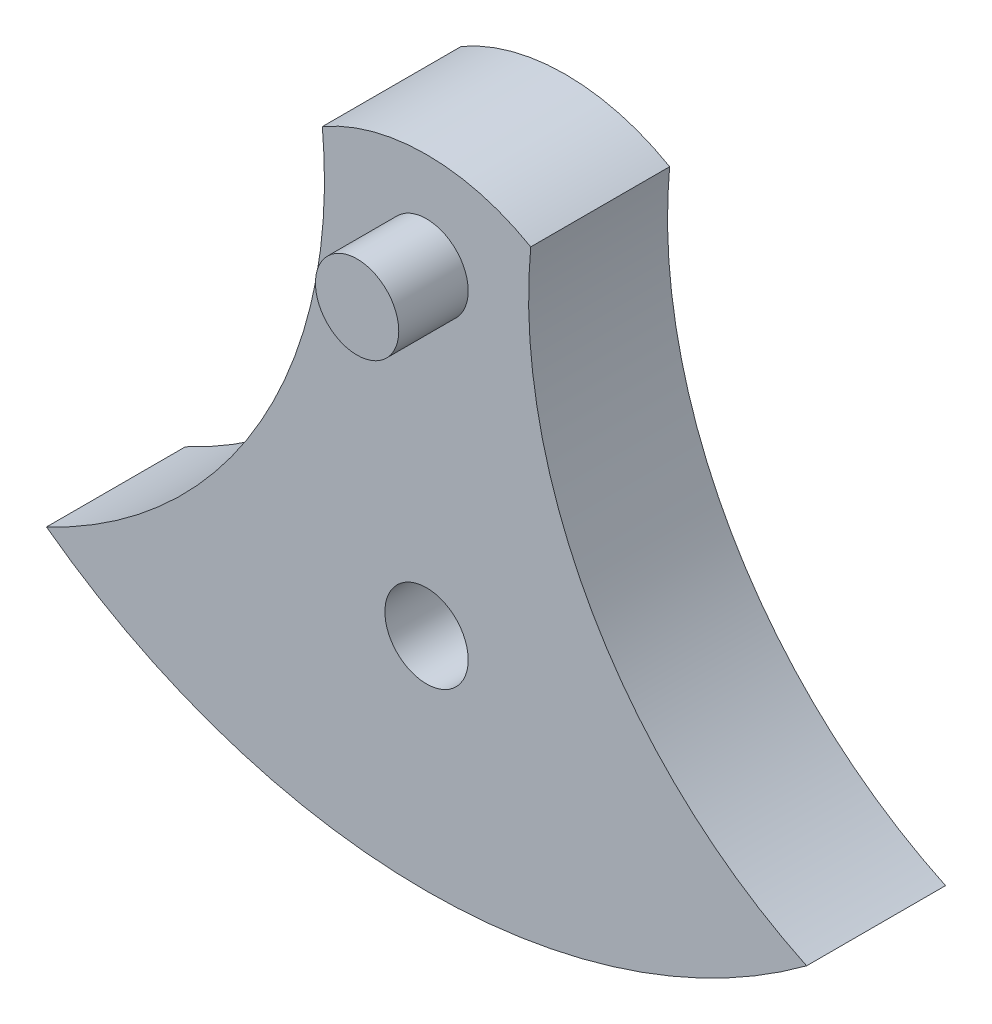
ISO-10303-21;
HEADER;
FILE_DESCRIPTION(('STEP AP214'),'2;1');
FILE_NAME('part.step','',(''),(''),'','','');
FILE_SCHEMA(('AUTOMOTIVE_DESIGN { 1 0 10303 214 1 1 1 1 }'));
ENDSEC;
DATA;
#1=APPLICATION_CONTEXT('core data for automotive mechanical design processes');
#2=APPLICATION_PROTOCOL_DEFINITION('international standard','automotive_design',2000,#1);
#3=PRODUCT_CONTEXT('',#1,'mechanical');
#4=PRODUCT('Part','Part','',(#3));
#5=PRODUCT_RELATED_PRODUCT_CATEGORY('part','',(#4));
#6=PRODUCT_DEFINITION_FORMATION('','',#4);
#7=PRODUCT_DEFINITION_CONTEXT('part definition',#1,'design');
#8=PRODUCT_DEFINITION('design','',#6,#7);
#9=PRODUCT_DEFINITION_SHAPE('','',#8);
#10=(LENGTH_UNIT() NAMED_UNIT(*) SI_UNIT(.MILLI.,.METRE.));
#11=(NAMED_UNIT(*) PLANE_ANGLE_UNIT() SI_UNIT($,.RADIAN.));
#12=(NAMED_UNIT(*) SI_UNIT($,.STERADIAN.) SOLID_ANGLE_UNIT());
#13=UNCERTAINTY_MEASURE_WITH_UNIT(LENGTH_MEASURE(1.E-05),#10,'distance_accuracy_value','');
#14=(GEOMETRIC_REPRESENTATION_CONTEXT(3) GLOBAL_UNCERTAINTY_ASSIGNED_CONTEXT((#13)) GLOBAL_UNIT_ASSIGNED_CONTEXT((#10,
#11,#12)) REPRESENTATION_CONTEXT('',''));
#15=CARTESIAN_POINT('',(0.,0.,0.));
#16=DIRECTION('',(0.,0.,1.));
#17=DIRECTION('',(1.,0.,0.));
#18=AXIS2_PLACEMENT_3D('',#15,#16,#17);
#19=CARTESIAN_POINT('',(0.,0.,5.));
#20=DIRECTION('',(0.,0.,-1.));
#21=DIRECTION('',(-1.,0.,0.));
#22=AXIS2_PLACEMENT_3D('',#19,#20,#21);
#23=CYLINDRICAL_SURFACE('',#22,3.);
#24=CARTESIAN_POINT('',(0.,0.,5.));
#25=DIRECTION('',(0.,0.,1.));
#26=DIRECTION('',(1.,0.,0.));
#27=AXIS2_PLACEMENT_3D('',#24,#25,#26);
#28=CIRCLE('',#27,3.);
#29=CARTESIAN_POINT('',(3.,0.,5.));
#30=VERTEX_POINT('',#29);
#31=EDGE_CURVE('E11',#30,#30,#28,.T.);
#32=ORIENTED_EDGE('',*,*,#31,.F.);
#33=EDGE_LOOP('',(#32));
#34=FACE_BOUND('',#33,.T.);
#35=CARTESIAN_POINT('',(0.,0.,0.));
#36=DIRECTION('',(0.,0.,1.));
#37=DIRECTION('',(1.,0.,0.));
#38=AXIS2_PLACEMENT_3D('',#35,#36,#37);
#39=CIRCLE('',#38,3.);
#40=CARTESIAN_POINT('',(3.,0.,0.));
#41=VERTEX_POINT('',#40);
#42=EDGE_CURVE('E43',#41,#41,#39,.T.);
#43=ORIENTED_EDGE('',*,*,#42,.T.);
#44=EDGE_LOOP('',(#43));
#45=FACE_BOUND('',#44,.T.);
#46=ADVANCED_FACE('F40',(#34,#45),#23,.T.);
#47=CARTESIAN_POINT('',(0.,-71.6629294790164,5.));
#48=DIRECTION('',(0.,0.,1.));
#49=DIRECTION('',(1.,0.,0.));
#50=AXIS2_PLACEMENT_3D('',#47,#48,#49);
#51=PLANE('',#50);
#52=ORIENTED_EDGE('',*,*,#31,.T.);
#53=EDGE_LOOP('',(#52));
#54=FACE_BOUND('',#53,.T.);
#55=ADVANCED_FACE('F55',(#54),#51,.T.);
#56=CARTESIAN_POINT('',(0.,-71.6629294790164,0.));
#57=DIRECTION('',(0.,0.,1.));
#58=DIRECTION('',(1.,0.,0.));
#59=AXIS2_PLACEMENT_3D('',#56,#57,#58);
#60=PLANE('',#59);
#61=ORIENTED_EDGE('',*,*,#42,.F.);
#62=EDGE_LOOP('',(#61));
#63=FACE_BOUND('',#62,.T.);
#64=ADVANCED_FACE('F53',(#63),#60,.F.);
#65=CLOSED_SHELL('',(#46,#55,#64));
#66=MANIFOLD_SOLID_BREP('B2',#65);
#67=CARTESIAN_POINT('',(-42.3474785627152,1.73607018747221,-10.));
#68=DIRECTION('',(0.,0.,1.));
#69=DIRECTION('',(1.,0.,0.));
#70=AXIS2_PLACEMENT_3D('',#67,#68,#69);
#71=CYLINDRICAL_SURFACE('',#70,35.);
#72=CARTESIAN_POINT('',(-42.3474785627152,1.73607018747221,0.));
#73=DIRECTION('',(0.,0.,1.));
#74=DIRECTION('',(1.,0.,0.));
#75=AXIS2_PLACEMENT_3D('',#72,#73,#74);
#76=CIRCLE('',#75,35.);
#77=CARTESIAN_POINT('',(-7.50000000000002,5.,0.));
#78=VERTEX_POINT('',#77);
#79=CARTESIAN_POINT('',(-27.3618481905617,-29.8935185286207,0.));
#80=VERTEX_POINT('',#79);
#81=EDGE_CURVE('E154',#78,#80,#76,.F.);
#82=ORIENTED_EDGE('',*,*,#81,.F.);
#83=DIRECTION('',(0.,0.,1.));
#84=VECTOR('',#83,1.);
#85=CARTESIAN_POINT('',(-7.50000000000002,5.,-10.));
#86=LINE('',#85,#84);
#87=CARTESIAN_POINT('',(-7.50000000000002,5.,-10.));
#88=VERTEX_POINT('',#87);
#89=EDGE_CURVE('E38',#88,#78,#86,.T.);
#90=ORIENTED_EDGE('',*,*,#89,.F.);
#91=CARTESIAN_POINT('',(-42.3474785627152,1.73607018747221,-10.));
#92=DIRECTION('',(0.,0.,1.));
#93=DIRECTION('',(1.,0.,0.));
#94=AXIS2_PLACEMENT_3D('',#91,#92,#93);
#95=CIRCLE('',#94,35.);
#96=CARTESIAN_POINT('',(-27.3618481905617,-29.8935185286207,-10.));
#97=VERTEX_POINT('',#96);
#98=EDGE_CURVE('E141',#88,#97,#95,.F.);
#99=ORIENTED_EDGE('',*,*,#98,.T.);
#100=DIRECTION('',(0.,0.,1.));
#101=VECTOR('',#100,1.);
#102=CARTESIAN_POINT('',(-27.3618481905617,-29.8935185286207,-10.));
#103=LINE('',#102,#101);
#104=EDGE_CURVE('E84',#97,#80,#103,.T.);
#105=ORIENTED_EDGE('',*,*,#104,.T.);
#106=EDGE_LOOP('',(#82,#90,#99,#105));
#107=FACE_BOUND('',#106,.T.);
#108=ADVANCED_FACE('F80',(#107),#71,.F.);
#109=CARTESIAN_POINT('',(0.,-7.99038105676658,-10.));
#110=DIRECTION('',(0.,0.,1.));
#111=DIRECTION('',(1.,0.,0.));
#112=AXIS2_PLACEMENT_3D('',#109,#110,#111);
#113=CYLINDRICAL_SURFACE('',#112,15.);
#114=CARTESIAN_POINT('',(0.,-7.99038105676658,0.));
#115=DIRECTION('',(0.,0.,1.));
#116=DIRECTION('',(1.,0.,0.));
#117=AXIS2_PLACEMENT_3D('',#114,#115,#116);
#118=CIRCLE('',#117,15.);
#119=CARTESIAN_POINT('',(7.50000000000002,5.,0.));
#120=VERTEX_POINT('',#119);
#121=EDGE_CURVE('E160',#78,#120,#118,.F.);
#122=ORIENTED_EDGE('',*,*,#121,.T.);
#123=DIRECTION('',(0.,0.,1.));
#124=VECTOR('',#123,1.);
#125=CARTESIAN_POINT('',(7.50000000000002,5.,-10.));
#126=LINE('',#125,#124);
#127=CARTESIAN_POINT('',(7.50000000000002,5.,-10.));
#128=VERTEX_POINT('',#127);
#129=EDGE_CURVE('E90',#128,#120,#126,.T.);
#130=ORIENTED_EDGE('',*,*,#129,.F.);
#131=CARTESIAN_POINT('',(0.,-7.99038105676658,-10.));
#132=DIRECTION('',(0.,0.,1.));
#133=DIRECTION('',(1.,0.,0.));
#134=AXIS2_PLACEMENT_3D('',#131,#132,#133);
#135=CIRCLE('',#134,15.);
#136=EDGE_CURVE('E134',#88,#128,#135,.F.);
#137=ORIENTED_EDGE('',*,*,#136,.F.);
#138=ORIENTED_EDGE('',*,*,#89,.T.);
#139=EDGE_LOOP('',(#122,#130,#137,#138));
#140=FACE_BOUND('',#139,.T.);
#141=ADVANCED_FACE('F163',(#140),#113,.T.);
#142=CARTESIAN_POINT('',(42.3474785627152,1.7360701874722,-10.));
#143=DIRECTION('',(0.,0.,1.));
#144=DIRECTION('',(1.,0.,0.));
#145=AXIS2_PLACEMENT_3D('',#142,#143,#144);
#146=CYLINDRICAL_SURFACE('',#145,35.);
#147=CARTESIAN_POINT('',(42.3474785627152,1.7360701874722,0.));
#148=DIRECTION('',(0.,0.,1.));
#149=DIRECTION('',(1.,0.,0.));
#150=AXIS2_PLACEMENT_3D('',#147,#148,#149);
#151=CIRCLE('',#150,35.);
#152=CARTESIAN_POINT('',(27.3618481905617,-29.8935185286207,0.));
#153=VERTEX_POINT('',#152);
#154=EDGE_CURVE('E115',#120,#153,#151,.T.);
#155=ORIENTED_EDGE('',*,*,#154,.T.);
#156=DIRECTION('',(0.,0.,1.));
#157=VECTOR('',#156,1.);
#158=CARTESIAN_POINT('',(27.3618481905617,-29.8935185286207,-10.));
#159=LINE('',#158,#157);
#160=CARTESIAN_POINT('',(27.3618481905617,-29.8935185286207,-10.));
#161=VERTEX_POINT('',#160);
#162=EDGE_CURVE('E138',#161,#153,#159,.T.);
#163=ORIENTED_EDGE('',*,*,#162,.F.);
#164=CARTESIAN_POINT('',(42.3474785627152,1.7360701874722,-10.));
#165=DIRECTION('',(0.,0.,1.));
#166=DIRECTION('',(1.,0.,0.));
#167=AXIS2_PLACEMENT_3D('',#164,#165,#166);
#168=CIRCLE('',#167,35.);
#169=EDGE_CURVE('E129',#128,#161,#168,.T.);
#170=ORIENTED_EDGE('',*,*,#169,.F.);
#171=ORIENTED_EDGE('',*,*,#129,.T.);
#172=EDGE_LOOP('',(#155,#163,#170,#171));
#173=FACE_BOUND('',#172,.T.);
#174=ADVANCED_FACE('F139',(#173),#146,.F.);
#175=CARTESIAN_POINT('',(0.,0.,-10.));
#176=DIRECTION('',(0.,0.,1.));
#177=DIRECTION('',(1.,0.,0.));
#178=AXIS2_PLACEMENT_3D('',#175,#176,#177);
#179=CYLINDRICAL_SURFACE('',#178,3.);
#180=CARTESIAN_POINT('',(0.,0.,-10.));
#181=DIRECTION('',(0.,0.,1.));
#182=DIRECTION('',(1.,0.,0.));
#183=AXIS2_PLACEMENT_3D('',#180,#181,#182);
#184=CIRCLE('',#183,3.);
#185=CARTESIAN_POINT('',(3.,0.,-10.));
#186=VERTEX_POINT('',#185);
#187=EDGE_CURVE('E143',#186,#186,#184,.T.);
#188=ORIENTED_EDGE('',*,*,#187,.F.);
#189=EDGE_LOOP('',(#188));
#190=FACE_BOUND('',#189,.T.);
#191=CARTESIAN_POINT('',(0.,0.,0.));
#192=DIRECTION('',(0.,0.,1.));
#193=DIRECTION('',(1.,0.,0.));
#194=AXIS2_PLACEMENT_3D('',#191,#192,#193);
#195=CIRCLE('',#194,3.);
#196=CARTESIAN_POINT('',(3.,0.,0.));
#197=VERTEX_POINT('',#196);
#198=EDGE_CURVE('E151',#197,#197,#195,.T.);
#199=ORIENTED_EDGE('',*,*,#198,.T.);
#200=EDGE_LOOP('',(#199));
#201=FACE_BOUND('',#200,.T.);
#202=ADVANCED_FACE('F173',(#190,#201),#179,.F.);
#203=CARTESIAN_POINT('',(0.,-23.,-10.));
#204=DIRECTION('',(0.,0.,1.));
#205=DIRECTION('',(1.,0.,0.));
#206=AXIS2_PLACEMENT_3D('',#203,#204,#205);
#207=CYLINDRICAL_SURFACE('',#206,3.);
#208=CARTESIAN_POINT('',(0.,-23.,-10.));
#209=DIRECTION('',(0.,0.,1.));
#210=DIRECTION('',(1.,0.,0.));
#211=AXIS2_PLACEMENT_3D('',#208,#209,#210);
#212=CIRCLE('',#211,3.);
#213=CARTESIAN_POINT('',(3.,-23.,-10.));
#214=VERTEX_POINT('',#213);
#215=EDGE_CURVE('E161',#214,#214,#212,.T.);
#216=ORIENTED_EDGE('',*,*,#215,.F.);
#217=EDGE_LOOP('',(#216));
#218=FACE_BOUND('',#217,.T.);
#219=CARTESIAN_POINT('',(0.,-23.,0.));
#220=DIRECTION('',(0.,0.,1.));
#221=DIRECTION('',(1.,0.,0.));
#222=AXIS2_PLACEMENT_3D('',#219,#220,#221);
#223=CIRCLE('',#222,3.);
#224=CARTESIAN_POINT('',(3.,-23.,0.));
#225=VERTEX_POINT('',#224);
#226=EDGE_CURVE('E148',#225,#225,#223,.T.);
#227=ORIENTED_EDGE('',*,*,#226,.T.);
#228=EDGE_LOOP('',(#227));
#229=FACE_BOUND('',#228,.T.);
#230=ADVANCED_FACE('F82',(#218,#229),#207,.F.);
#231=CARTESIAN_POINT('',(0.,7.08389705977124,-10.));
#232=DIRECTION('',(0.,0.,1.));
#233=DIRECTION('',(1.,0.,0.));
#234=AXIS2_PLACEMENT_3D('',#231,#232,#233);
#235=CYLINDRICAL_SURFACE('',#234,46.);
#236=CARTESIAN_POINT('',(0.,7.08389705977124,0.));
#237=DIRECTION('',(0.,0.,1.));
#238=DIRECTION('',(1.,0.,0.));
#239=AXIS2_PLACEMENT_3D('',#236,#237,#238);
#240=CIRCLE('',#239,46.);
#241=EDGE_CURVE('E157',#80,#153,#240,.T.);
#242=ORIENTED_EDGE('',*,*,#241,.F.);
#243=ORIENTED_EDGE('',*,*,#104,.F.);
#244=CARTESIAN_POINT('',(0.,7.08389705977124,-10.));
#245=DIRECTION('',(0.,0.,1.));
#246=DIRECTION('',(1.,0.,0.));
#247=AXIS2_PLACEMENT_3D('',#244,#245,#246);
#248=CIRCLE('',#247,46.);
#249=EDGE_CURVE('E133',#97,#161,#248,.T.);
#250=ORIENTED_EDGE('',*,*,#249,.T.);
#251=ORIENTED_EDGE('',*,*,#162,.T.);
#252=EDGE_LOOP('',(#242,#243,#250,#251));
#253=FACE_BOUND('',#252,.T.);
#254=ADVANCED_FACE('F140',(#253),#235,.T.);
#255=CARTESIAN_POINT('',(0.,-71.6629294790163,-10.));
#256=DIRECTION('',(0.,0.,1.));
#257=DIRECTION('',(1.,0.,0.));
#258=AXIS2_PLACEMENT_3D('',#255,#256,#257);
#259=PLANE('',#258);
#260=ORIENTED_EDGE('',*,*,#215,.T.);
#261=EDGE_LOOP('',(#260));
#262=FACE_BOUND('',#261,.T.);
#263=ORIENTED_EDGE('',*,*,#187,.T.);
#264=EDGE_LOOP('',(#263));
#265=FACE_BOUND('',#264,.T.);
#266=ORIENTED_EDGE('',*,*,#98,.F.);
#267=ORIENTED_EDGE('',*,*,#136,.T.);
#268=ORIENTED_EDGE('',*,*,#169,.T.);
#269=ORIENTED_EDGE('',*,*,#249,.F.);
#270=EDGE_LOOP('',(#266,#267,#268,#269));
#271=FACE_BOUND('',#270,.T.);
#272=ADVANCED_FACE('F132',(#262,#265,#271),#259,.F.);
#273=CARTESIAN_POINT('',(0.,-71.6629294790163,0.));
#274=DIRECTION('',(0.,0.,1.));
#275=DIRECTION('',(1.,0.,0.));
#276=AXIS2_PLACEMENT_3D('',#273,#274,#275);
#277=PLANE('',#276);
#278=ORIENTED_EDGE('',*,*,#226,.F.);
#279=EDGE_LOOP('',(#278));
#280=FACE_BOUND('',#279,.T.);
#281=ORIENTED_EDGE('',*,*,#198,.F.);
#282=EDGE_LOOP('',(#281));
#283=FACE_BOUND('',#282,.T.);
#284=ORIENTED_EDGE('',*,*,#81,.T.);
#285=ORIENTED_EDGE('',*,*,#241,.T.);
#286=ORIENTED_EDGE('',*,*,#154,.F.);
#287=ORIENTED_EDGE('',*,*,#121,.F.);
#288=EDGE_LOOP('',(#284,#285,#286,#287));
#289=FACE_BOUND('',#288,.T.);
#290=ADVANCED_FACE('F164',(#280,#283,#289),#277,.T.);
#291=CLOSED_SHELL('',(#108,#141,#174,#202,#230,#254,#272,#290));
#292=MANIFOLD_SOLID_BREP('B6',#291);
#293=ADVANCED_BREP_SHAPE_REPRESENTATION('',(#18,#66,#292),#14);
#294=SHAPE_DEFINITION_REPRESENTATION(#9,#293);
ENDSEC;
END-ISO-10303-21;
